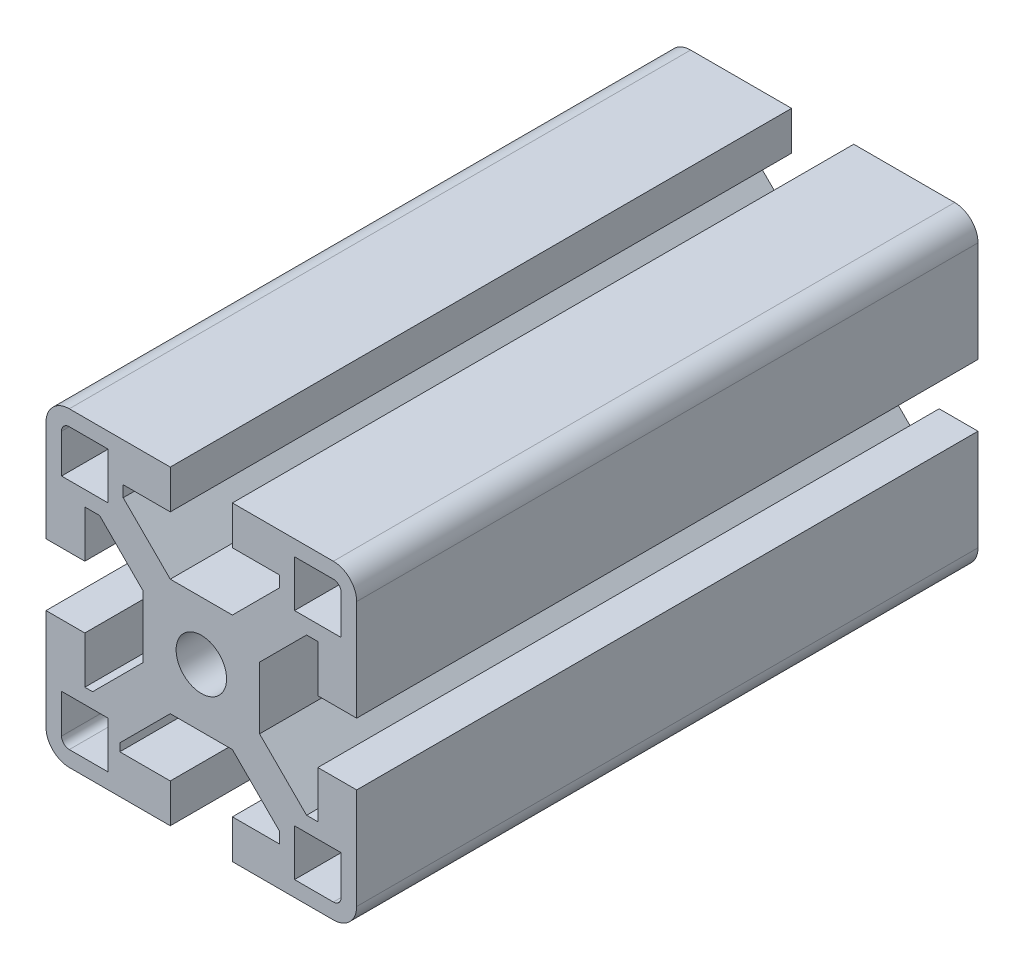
from build123d import *

# Parameters (mm, degrees)
CROQUIS1_R     = 3.25
EXTRUIR5_DEPTH = 80


with BuildPart() as part:
    # Croquis1 → Extruir5 (new body)
    with BuildSketch(Plane.XY):
        with BuildLine():
            Line((-4, 7.5), (4, 7.5))
            Line((4, 7.5), (10.05, 13.55))
            Line((10.05, 13.55), (10.05, 15))
            Line((10.05, 15), (4, 15))
            Line((4, 15), (4, 20))
            Line((4, 20), (17, 20))
            ThreePointArc((17, 20), (19.121320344, 19.121320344), (20, 17))
            Line((20, 17), (20, 4))
            Line((20, 4), (15, 4))
            Line((15, 4), (15, 10.05))
            Line((15, 10.05), (13.55, 10.05))
            Line((13.55, 10.05), (7.5, 4))
            Line((7.5, 4), (7.5, -4))
            Line((7.5, -4), (13.55, -10.05))
            Line((13.55, -10.05), (15, -10.05))
            Line((15, -10.05), (15, -4))
            Line((15, -4), (20, -4))
            Line((20, -4), (20, -17))
            ThreePointArc((20, -17), (19.121320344, -19.121320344), (17, -20))
            Line((17, -20), (4, -20))
            Line((4, -20), (4, -15))
            Line((4, -15), (10.05, -15))
            Line((10.05, -15), (10.05, -13.55))
            Line((10.05, -13.55), (4, -7.5))
            Line((4, -7.5), (-4, -7.5))
            Line((-4, -7.5), (-10.5, -14))
            Line((-10.5, -14), (-10.5, -15))
            Line((-10.5, -15), (-4, -15))
            Line((-4, -15), (-4, -20))
            Line((-4, -20), (-17, -20))
            ThreePointArc((-17, -20), (-19.121320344, -19.121320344), (-20, -17))
            Line((-20, -17), (-20, -4))
            Line((-20, -4), (-15, -4))
            Line((-15, -4), (-15, -10.05))
            Line((-15, -10.05), (-14, -10.05))
            Line((-14, -10.05), (-7.5, -3.55))
            Line((-7.5, -3.55), (-7.5, 4.45))
            Line((-7.5, 4.45), (-13.1, 10.05))
            Line((-13.1, 10.05), (-15, 10.05))
            Line((-15, 10.05), (-15, 4))
            Line((-15, 4), (-20, 4))
            Line((-20, 4), (-20, 17))
            ThreePointArc((-20, 17), (-19.121320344, 19.121320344), (-17, 20))
            Line((-17, 20), (-4, 20))
            Line((-4, 20), (-4, 15))
            Line((-4, 15), (-10.062875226, 15))
            Line((-10.062875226, 15), (-10.062875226, 13.55))
            Line((-10.062875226, 13.55), (-4, 7.5))
        make_face()
        Circle(CROQUIS1_R, mode=Mode.SUBTRACT)
        with BuildLine():
            Line((-18, 12), (-12, 12))
            Line((-12, 12), (-12, 18))
            Line((-12, 18), (-17, 18))
            ThreePointArc((-17, 18), (-17.707106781, 17.707106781), (-18, 17))
            Line((-18, 17), (-18, 12))
        make_face(mode=Mode.SUBTRACT)
        with BuildLine():
            Line((12, 12), (18, 12))
            Line((18, 12), (18, 17))
            ThreePointArc((18, 17), (17.707106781, 17.707106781), (17, 18))
            Line((17, 18), (12, 18))
            Line((12, 18), (12, 12))
        make_face(mode=Mode.SUBTRACT)
        with BuildLine():
            Line((-17, -18), (-12, -18))
            Line((-12, -18), (-12, -12))
            Line((-12, -12), (-18, -12))
            Line((-18, -12), (-18, -17))
            ThreePointArc((-18, -17), (-17.707106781, -17.707106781), (-17, -18))
        make_face(mode=Mode.SUBTRACT)
        with BuildLine():
            Line((18, -12), (12, -12))
            Line((12, -12), (12, -18))
            Line((12, -18), (17, -18))
            ThreePointArc((17, -18), (17.707106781, -17.707106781), (18, -17))
            Line((18, -17), (18, -12))
        make_face(mode=Mode.SUBTRACT)
    extrude(amount=EXTRUIR5_DEPTH)


solid = part.part
